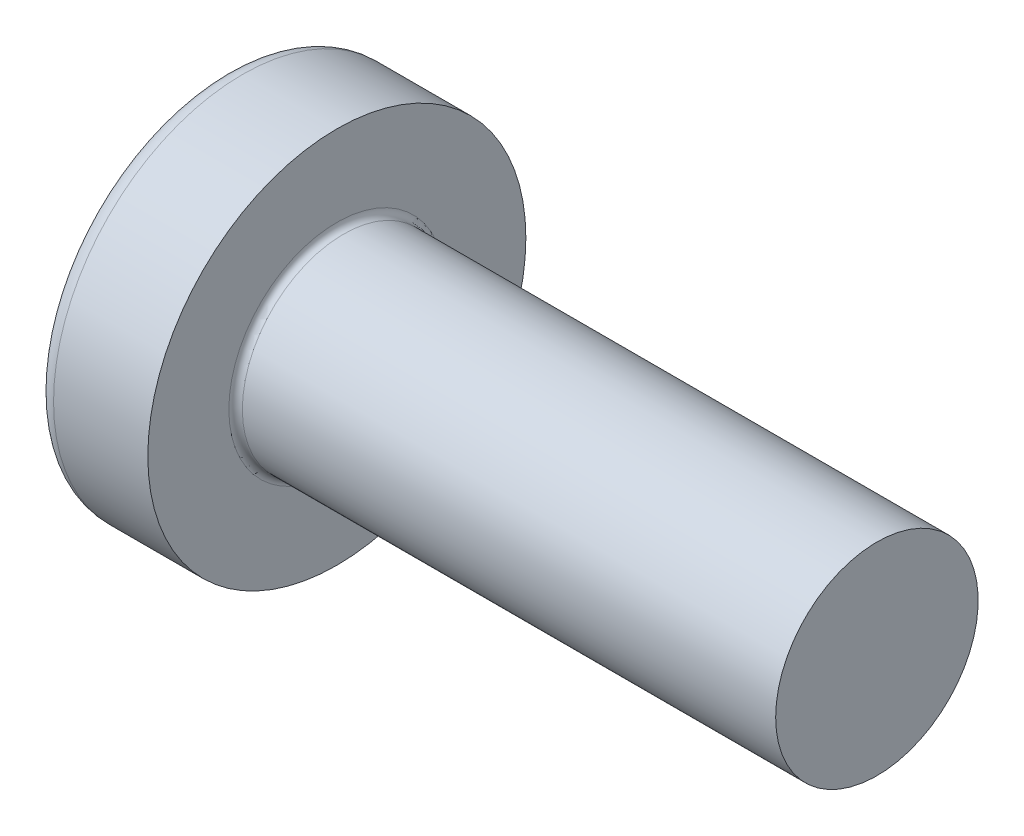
ISO-10303-21;
HEADER;
FILE_DESCRIPTION(('STEP AP214'),'2;1');
FILE_NAME('part.step','',(''),(''),'','','');
FILE_SCHEMA(('AUTOMOTIVE_DESIGN { 1 0 10303 214 1 1 1 1 }'));
ENDSEC;
DATA;
#1=APPLICATION_CONTEXT('core data for automotive mechanical design processes');
#2=APPLICATION_PROTOCOL_DEFINITION('international standard','automotive_design',2000,#1);
#3=PRODUCT_CONTEXT('',#1,'mechanical');
#4=PRODUCT('Part','Part','',(#3));
#5=PRODUCT_RELATED_PRODUCT_CATEGORY('part','',(#4));
#6=PRODUCT_DEFINITION_FORMATION('','',#4);
#7=PRODUCT_DEFINITION_CONTEXT('part definition',#1,'design');
#8=PRODUCT_DEFINITION('design','',#6,#7);
#9=PRODUCT_DEFINITION_SHAPE('','',#8);
#10=(LENGTH_UNIT() NAMED_UNIT(*) SI_UNIT(.MILLI.,.METRE.));
#11=(NAMED_UNIT(*) PLANE_ANGLE_UNIT() SI_UNIT($,.RADIAN.));
#12=(NAMED_UNIT(*) SI_UNIT($,.STERADIAN.) SOLID_ANGLE_UNIT());
#13=UNCERTAINTY_MEASURE_WITH_UNIT(LENGTH_MEASURE(1.E-05),#10,'distance_accuracy_value','');
#14=(GEOMETRIC_REPRESENTATION_CONTEXT(3) GLOBAL_UNCERTAINTY_ASSIGNED_CONTEXT((#13)) GLOBAL_UNIT_ASSIGNED_CONTEXT((#10,
#11,#12)) REPRESENTATION_CONTEXT('',''));
#15=CARTESIAN_POINT('',(0.,0.,0.));
#16=DIRECTION('',(0.,0.,1.));
#17=DIRECTION('',(1.,0.,0.));
#18=AXIS2_PLACEMENT_3D('',#15,#16,#17);
#19=CARTESIAN_POINT('',(5.,0.,0.));
#20=DIRECTION('',(-1.,0.,0.));
#21=DIRECTION('',(0.,1.,0.));
#22=AXIS2_PLACEMENT_3D('',#19,#20,#21);
#23=SPHERICAL_SURFACE('',#22,5.);
#24=CARTESIAN_POINT('',(0.775371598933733,0.,0.));
#25=DIRECTION('',(-1.,0.,0.));
#26=DIRECTION('',(0.,0.,1.));
#27=AXIS2_PLACEMENT_3D('',#24,#25,#26);
#28=CIRCLE('',#27,2.67441860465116);
#29=CARTESIAN_POINT('',(0.775371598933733,0.,2.67441860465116));
#30=VERTEX_POINT('',#29);
#31=EDGE_CURVE('E233',#30,#30,#28,.T.);
#32=ORIENTED_EDGE('',*,*,#31,.T.);
#33=EDGE_LOOP('',(#32));
#34=FACE_BOUND('',#33,.T.);
#35=CARTESIAN_POINT('',(0.0457951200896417,0.,0.));
#36=DIRECTION('',(1.,0.,0.));
#37=DIRECTION('',(0.,0.,-1.));
#38=AXIS2_PLACEMENT_3D('',#35,#36,#37);
#39=CIRCLE('',#38,0.675169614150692);
#40=CARTESIAN_POINT('',(0.0457951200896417,-0.369999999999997,-0.564760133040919));
#41=VERTEX_POINT('',#40);
#42=CARTESIAN_POINT('',(0.0457951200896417,-0.564760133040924,-0.37));
#43=VERTEX_POINT('',#42);
#44=EDGE_CURVE('E369',#41,#43,#39,.F.);
#45=ORIENTED_EDGE('',*,*,#44,.F.);
#46=CARTESIAN_POINT('',(5.,-0.370000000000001,0.));
#47=DIRECTION('',(0.,1.,0.));
#48=DIRECTION('',(0.,0.,1.));
#49=AXIS2_PLACEMENT_3D('',#46,#47,#48);
#50=CIRCLE('',#49,4.98629120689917);
#51=CARTESIAN_POINT('',(0.187869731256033,-0.369999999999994,-1.30633161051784));
#52=VERTEX_POINT('',#51);
#53=EDGE_CURVE('E295',#52,#41,#50,.T.);
#54=ORIENTED_EDGE('',*,*,#53,.F.);
#55=CARTESIAN_POINT('',(4.56358245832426,0.,0.87531820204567));
#56=DIRECTION('',(0.446197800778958,0.,-0.89493436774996));
#57=DIRECTION('',(-0.89493436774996,0.,-0.446197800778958));
#58=AXIS2_PLACEMENT_3D('',#55,#56,#57);
#59=CIRCLE('',#58,4.90340267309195);
#60=CARTESIAN_POINT('',(0.187869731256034,0.370000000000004,-1.30633161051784));
#61=VERTEX_POINT('',#60);
#62=EDGE_CURVE('E267',#52,#61,#59,.T.);
#63=ORIENTED_EDGE('',*,*,#62,.T.);
#64=CARTESIAN_POINT('',(5.,0.37,0.));
#65=DIRECTION('',(0.,-1.,0.));
#66=DIRECTION('',(0.,0.,-1.));
#67=AXIS2_PLACEMENT_3D('',#64,#65,#66);
#68=CIRCLE('',#67,4.98629120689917);
#69=CARTESIAN_POINT('',(0.0457951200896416,0.370000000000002,-0.564760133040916));
#70=VERTEX_POINT('',#69);
#71=EDGE_CURVE('E322',#70,#61,#68,.T.);
#72=ORIENTED_EDGE('',*,*,#71,.F.);
#73=CARTESIAN_POINT('',(0.0457951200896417,0.564760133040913,-0.37));
#74=VERTEX_POINT('',#73);
#75=EDGE_CURVE('E388',#74,#70,#39,.F.);
#76=ORIENTED_EDGE('',*,*,#75,.F.);
#77=CARTESIAN_POINT('',(5.,0.,-0.37));
#78=DIRECTION('',(0.,0.,1.));
#79=DIRECTION('',(0.,-1.,0.));
#80=AXIS2_PLACEMENT_3D('',#77,#78,#79);
#81=CIRCLE('',#80,4.98629120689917);
#82=CARTESIAN_POINT('',(0.187869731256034,1.30633161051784,-0.37));
#83=VERTEX_POINT('',#82);
#84=EDGE_CURVE('E261',#83,#74,#81,.T.);
#85=ORIENTED_EDGE('',*,*,#84,.F.);
#86=CARTESIAN_POINT('',(4.56358245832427,-0.87531820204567,0.));
#87=DIRECTION('',(0.446197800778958,0.89493436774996,0.));
#88=DIRECTION('',(-0.89493436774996,0.446197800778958,0.));
#89=AXIS2_PLACEMENT_3D('',#86,#87,#88);
#90=CIRCLE('',#89,4.90340267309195);
#91=CARTESIAN_POINT('',(0.187869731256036,1.30633161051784,0.37));
#92=VERTEX_POINT('',#91);
#93=EDGE_CURVE('E264',#83,#92,#90,.T.);
#94=ORIENTED_EDGE('',*,*,#93,.T.);
#95=CARTESIAN_POINT('',(5.,0.,0.370000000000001));
#96=DIRECTION('',(0.,0.,-1.));
#97=DIRECTION('',(-1.,0.,0.));
#98=AXIS2_PLACEMENT_3D('',#95,#96,#97);
#99=CIRCLE('',#98,4.98629120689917);
#100=CARTESIAN_POINT('',(0.0457951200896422,0.564760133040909,0.369999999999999));
#101=VERTEX_POINT('',#100);
#102=EDGE_CURVE('E257',#101,#92,#99,.T.);
#103=ORIENTED_EDGE('',*,*,#102,.F.);
#104=CARTESIAN_POINT('',(0.0457951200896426,0.369999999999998,0.564760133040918));
#105=VERTEX_POINT('',#104);
#106=EDGE_CURVE('E387',#105,#101,#39,.F.);
#107=ORIENTED_EDGE('',*,*,#106,.F.);
#108=CARTESIAN_POINT('',(0.187869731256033,0.369999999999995,1.30633161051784));
#109=VERTEX_POINT('',#108);
#110=EDGE_CURVE('E277',#109,#105,#68,.T.);
#111=ORIENTED_EDGE('',*,*,#110,.F.);
#112=CARTESIAN_POINT('',(4.56358245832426,0.,-0.875318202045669));
#113=DIRECTION('',(0.446197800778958,0.,0.89493436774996));
#114=DIRECTION('',(0.89493436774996,0.,-0.446197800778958));
#115=AXIS2_PLACEMENT_3D('',#112,#113,#114);
#116=CIRCLE('',#115,4.90340267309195);
#117=CARTESIAN_POINT('',(0.187869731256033,-0.370000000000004,1.30633161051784));
#118=VERTEX_POINT('',#117);
#119=EDGE_CURVE('E44',#109,#118,#116,.T.);
#120=ORIENTED_EDGE('',*,*,#119,.T.);
#121=CARTESIAN_POINT('',(0.0457951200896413,-0.370000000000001,0.564760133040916));
#122=VERTEX_POINT('',#121);
#123=EDGE_CURVE('E274',#122,#118,#50,.T.);
#124=ORIENTED_EDGE('',*,*,#123,.F.);
#125=CARTESIAN_POINT('',(0.0457951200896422,-0.56476013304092,0.369999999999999));
#126=VERTEX_POINT('',#125);
#127=EDGE_CURVE('E423',#126,#122,#39,.F.);
#128=ORIENTED_EDGE('',*,*,#127,.F.);
#129=CARTESIAN_POINT('',(0.187869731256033,-1.30633161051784,0.369999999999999));
#130=VERTEX_POINT('',#129);
#131=EDGE_CURVE('E258',#130,#126,#99,.T.);
#132=ORIENTED_EDGE('',*,*,#131,.F.);
#133=CARTESIAN_POINT('',(4.56358245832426,0.875318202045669,0.));
#134=DIRECTION('',(0.446197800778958,-0.89493436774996,0.));
#135=DIRECTION('',(0.89493436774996,0.446197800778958,0.));
#136=AXIS2_PLACEMENT_3D('',#133,#134,#135);
#137=CIRCLE('',#136,4.90340267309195);
#138=CARTESIAN_POINT('',(0.187869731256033,-1.30633161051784,-0.37));
#139=VERTEX_POINT('',#138);
#140=EDGE_CURVE('E254',#130,#139,#137,.T.);
#141=ORIENTED_EDGE('',*,*,#140,.T.);
#142=EDGE_CURVE('E59',#43,#139,#81,.T.);
#143=ORIENTED_EDGE('',*,*,#142,.F.);
#144=EDGE_LOOP('',(#45,#54,#63,#72,#76,#85,#94,#103,#107,#111,#120,#124,#128,#132,#141,#143));
#145=FACE_BOUND('',#144,.T.);
#146=ADVANCED_FACE('F31',(#34,#145),#23,.T.);
#147=CARTESIAN_POINT('',(1.75,0.527482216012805,-0.37));
#148=DIRECTION('',(0.,0.,1.));
#149=DIRECTION('',(0.,-1.,0.));
#150=AXIS2_PLACEMENT_3D('',#147,#148,#149);
#151=PLANE('',#150);
#152=ORIENTED_EDGE('',*,*,#84,.T.);
#153=CARTESIAN_POINT('',(-0.987293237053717,0.649401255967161,-0.37));
#154=CARTESIAN_POINT('',(-0.781914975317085,0.632865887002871,-0.37));
#155=CARTESIAN_POINT('',(-0.576547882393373,0.616188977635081,-0.37));
#156=CARTESIAN_POINT('',(-0.165841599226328,0.582441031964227,-0.37));
#157=CARTESIAN_POINT('',(0.0394975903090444,0.56536998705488,-0.37));
#158=CARTESIAN_POINT('',(0.450133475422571,0.530723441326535,-0.37));
#159=CARTESIAN_POINT('',(0.655430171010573,0.513147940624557,-0.37));
#160=CARTESIAN_POINT('',(1.06596140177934,0.477314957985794,-0.37));
#161=CARTESIAN_POINT('',(1.2711959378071,0.459057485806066,-0.37));
#162=CARTESIAN_POINT('',(1.61065292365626,0.428051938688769,-0.37));
#163=CARTESIAN_POINT('',(1.74490059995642,0.415580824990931,-0.37));
#164=CARTESIAN_POINT('',(2.01334321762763,0.390092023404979,-0.37));
#165=CARTESIAN_POINT('',(2.14753815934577,0.377074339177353,-0.37));
#166=CARTESIAN_POINT('',(2.41586354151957,0.350315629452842,-0.37));
#167=CARTESIAN_POINT('',(2.5499939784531,0.33657456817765,-0.37));
#168=CARTESIAN_POINT('',(2.81814173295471,0.308004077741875,-0.37));
#169=CARTESIAN_POINT('',(2.95215904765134,0.293174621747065,-0.37));
#170=CARTESIAN_POINT('',(3.0860955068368,0.277618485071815,-0.37));
#171=B_SPLINE_CURVE_WITH_KNOTS('',3,(#153,#154,#155,#156,#157,#158,#159,#160,#161,#162,#163,
#164,#165,#166,#167,#168,#169,#170),.UNSPECIFIED.,.F.,.F.,(4,2,2,2,2,2,2,2,4),(0.,
0.618128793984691,1.23627109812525,1.85441325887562,2.4725465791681,2.87702276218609,
3.28149623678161,3.68598973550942,4.09049321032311),.UNSPECIFIED.);
#172=CARTESIAN_POINT('',(1.75,0.415013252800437,-0.370000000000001));
#173=VERTEX_POINT('',#172);
#174=EDGE_CURVE('E409',#74,#173,#171,.T.);
#175=ORIENTED_EDGE('',*,*,#174,.T.);
#176=DIRECTION('',(0.,1.,0.));
#177=VECTOR('',#176,1.);
#178=CARTESIAN_POINT('',(1.75,-0.527482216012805,-0.37));
#179=LINE('',#178,#177);
#180=CARTESIAN_POINT('',(1.75,0.527482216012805,-0.37));
#181=VERTEX_POINT('',#180);
#182=EDGE_CURVE('E351',#173,#181,#179,.T.);
#183=ORIENTED_EDGE('',*,*,#182,.T.);
#184=DIRECTION('',(0.89493436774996,-0.446197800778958,0.));
#185=VECTOR('',#184,1.);
#186=CARTESIAN_POINT('',(0.,1.4,-0.37));
#187=LINE('',#186,#185);
#188=EDGE_CURVE('E234',#83,#181,#187,.T.);
#189=ORIENTED_EDGE('',*,*,#188,.F.);
#190=EDGE_LOOP('',(#152,#175,#183,#189));
#191=FACE_BOUND('',#190,.T.);
#192=ADVANCED_FACE('F189',(#191),#151,.T.);
#193=CARTESIAN_POINT('',(1.75,-0.527482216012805,-0.37));
#194=VERTEX_POINT('',#193);
#195=CARTESIAN_POINT('',(1.75,-0.415013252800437,-0.37));
#196=VERTEX_POINT('',#195);
#197=EDGE_CURVE('E242',#194,#196,#179,.T.);
#198=ORIENTED_EDGE('',*,*,#197,.T.);
#199=CARTESIAN_POINT('',(-0.987293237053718,-0.649401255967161,-0.37));
#200=CARTESIAN_POINT('',(-0.781914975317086,-0.632865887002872,-0.37));
#201=CARTESIAN_POINT('',(-0.576547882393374,-0.616188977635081,-0.37));
#202=CARTESIAN_POINT('',(-0.165841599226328,-0.582441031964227,-0.37));
#203=CARTESIAN_POINT('',(0.0394975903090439,-0.56536998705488,-0.37));
#204=CARTESIAN_POINT('',(0.450133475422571,-0.530723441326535,-0.37));
#205=CARTESIAN_POINT('',(0.655430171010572,-0.513147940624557,-0.37));
#206=CARTESIAN_POINT('',(1.06596140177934,-0.477314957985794,-0.37));
#207=CARTESIAN_POINT('',(1.2711959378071,-0.459057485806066,-0.37));
#208=CARTESIAN_POINT('',(1.61065292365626,-0.428051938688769,-0.37));
#209=CARTESIAN_POINT('',(1.74490059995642,-0.415580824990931,-0.37));
#210=CARTESIAN_POINT('',(2.01334321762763,-0.39009202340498,-0.37));
#211=CARTESIAN_POINT('',(2.14753815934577,-0.377074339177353,-0.37));
#212=CARTESIAN_POINT('',(2.41586354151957,-0.350315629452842,-0.37));
#213=CARTESIAN_POINT('',(2.5499939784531,-0.33657456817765,-0.37));
#214=CARTESIAN_POINT('',(2.81814173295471,-0.308004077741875,-0.37));
#215=CARTESIAN_POINT('',(2.95215904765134,-0.293174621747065,-0.37));
#216=CARTESIAN_POINT('',(3.0860955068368,-0.277618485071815,-0.37));
#217=B_SPLINE_CURVE_WITH_KNOTS('',3,(#199,#200,#201,#202,#203,#204,#205,#206,#207,#208,#209,
#210,#211,#212,#213,#214,#215,#216),.UNSPECIFIED.,.F.,.F.,(4,2,2,2,2,2,2,2,4),(0.,
0.618128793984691,1.23627109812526,1.85441325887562,2.4725465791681,2.87702276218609,
3.28149623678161,3.68598973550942,4.09049321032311),.UNSPECIFIED.);
#218=EDGE_CURVE('E386',#196,#43,#217,.F.);
#219=ORIENTED_EDGE('',*,*,#218,.T.);
#220=ORIENTED_EDGE('',*,*,#142,.T.);
#221=DIRECTION('',(0.89493436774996,0.446197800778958,0.));
#222=VECTOR('',#221,1.);
#223=CARTESIAN_POINT('',(0.,-1.4,-0.37));
#224=LINE('',#223,#222);
#225=EDGE_CURVE('E325',#139,#194,#224,.T.);
#226=ORIENTED_EDGE('',*,*,#225,.T.);
#227=EDGE_LOOP('',(#198,#219,#220,#226));
#228=FACE_BOUND('',#227,.T.);
#229=ADVANCED_FACE('F195',(#228),#151,.T.);
#230=CARTESIAN_POINT('',(1.75,-0.527482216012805,0.37));
#231=DIRECTION('',(0.,0.,-1.));
#232=DIRECTION('',(-1.,0.,0.));
#233=AXIS2_PLACEMENT_3D('',#230,#231,#232);
#234=PLANE('',#233);
#235=DIRECTION('',(0.,-1.,0.));
#236=VECTOR('',#235,1.);
#237=CARTESIAN_POINT('',(1.75,0.527482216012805,0.37));
#238=LINE('',#237,#236);
#239=CARTESIAN_POINT('',(1.75,0.527482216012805,0.37));
#240=VERTEX_POINT('',#239);
#241=CARTESIAN_POINT('',(1.75,0.415013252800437,0.37));
#242=VERTEX_POINT('',#241);
#243=EDGE_CURVE('E334',#240,#242,#238,.T.);
#244=ORIENTED_EDGE('',*,*,#243,.T.);
#245=CARTESIAN_POINT('',(-0.987293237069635,0.649401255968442,0.369999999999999));
#246=CARTESIAN_POINT('',(-0.781914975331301,0.632865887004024,0.369999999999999));
#247=CARTESIAN_POINT('',(-0.576547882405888,0.616188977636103,0.369999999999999));
#248=CARTESIAN_POINT('',(-0.165841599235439,0.582441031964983,0.369999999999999));
#249=CARTESIAN_POINT('',(0.039497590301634,0.5653699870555,0.369999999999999));
#250=CARTESIAN_POINT('',(0.450133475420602,0.530723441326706,0.37));
#251=CARTESIAN_POINT('',(0.655430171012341,0.513147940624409,0.37));
#252=CARTESIAN_POINT('',(1.06596140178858,0.477314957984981,0.37));
#253=CARTESIAN_POINT('',(1.27119593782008,0.459057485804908,0.37));
#254=CARTESIAN_POINT('',(1.61065292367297,0.428051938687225,0.37));
#255=CARTESIAN_POINT('',(1.74490059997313,0.415580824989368,0.37));
#256=CARTESIAN_POINT('',(2.01334321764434,0.390092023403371,0.37));
#257=CARTESIAN_POINT('',(2.14753815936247,0.377074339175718,0.37));
#258=CARTESIAN_POINT('',(2.41586354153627,0.350315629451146,0.37));
#259=CARTESIAN_POINT('',(2.54999397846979,0.336574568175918,0.37));
#260=CARTESIAN_POINT('',(2.8181417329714,0.308004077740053,0.37));
#261=CARTESIAN_POINT('',(2.95215904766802,0.293174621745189,0.37));
#262=CARTESIAN_POINT('',(3.08609550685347,0.277618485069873,0.37));
#263=B_SPLINE_CURVE_WITH_KNOTS('',3,(#245,#246,#247,#248,#249,#250,#251,#252,#253,#254,#255,
#256,#257,#258,#259,#260,#261,#262),.UNSPECIFIED.,.F.,.F.,(4,2,2,2,2,2,2,2,4),(0.,
0.618128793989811,1.23627109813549,1.85441325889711,2.47254657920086,2.87702276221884,
3.28149623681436,3.68598973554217,4.09049321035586),.UNSPECIFIED.);
#264=EDGE_CURVE('E659',#242,#101,#263,.F.);
#265=ORIENTED_EDGE('',*,*,#264,.T.);
#266=ORIENTED_EDGE('',*,*,#102,.T.);
#267=DIRECTION('',(0.89493436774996,-0.446197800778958,0.));
#268=VECTOR('',#267,1.);
#269=CARTESIAN_POINT('',(0.,1.4,0.37));
#270=LINE('',#269,#268);
#271=EDGE_CURVE('E239',#92,#240,#270,.T.);
#272=ORIENTED_EDGE('',*,*,#271,.T.);
#273=EDGE_LOOP('',(#244,#265,#266,#272));
#274=FACE_BOUND('',#273,.T.);
#275=ADVANCED_FACE('F405',(#274),#234,.T.);
#276=ORIENTED_EDGE('',*,*,#131,.T.);
#277=CARTESIAN_POINT('',(-0.987293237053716,-0.649401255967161,0.369999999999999));
#278=CARTESIAN_POINT('',(-0.781914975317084,-0.632865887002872,0.369999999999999));
#279=CARTESIAN_POINT('',(-0.576547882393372,-0.616188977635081,0.369999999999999));
#280=CARTESIAN_POINT('',(-0.165841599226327,-0.582441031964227,0.369999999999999));
#281=CARTESIAN_POINT('',(0.0394975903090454,-0.56536998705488,0.369999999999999));
#282=CARTESIAN_POINT('',(0.450133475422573,-0.530723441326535,0.369999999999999));
#283=CARTESIAN_POINT('',(0.655430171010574,-0.513147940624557,0.369999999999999));
#284=CARTESIAN_POINT('',(1.06596140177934,-0.477314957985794,0.369999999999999));
#285=CARTESIAN_POINT('',(1.2711959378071,-0.459057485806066,0.37));
#286=CARTESIAN_POINT('',(1.61065292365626,-0.428051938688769,0.37));
#287=CARTESIAN_POINT('',(1.74490059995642,-0.415580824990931,0.37));
#288=CARTESIAN_POINT('',(2.01334321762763,-0.39009202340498,0.37));
#289=CARTESIAN_POINT('',(2.14753815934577,-0.377074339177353,0.37));
#290=CARTESIAN_POINT('',(2.41586354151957,-0.350315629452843,0.37));
#291=CARTESIAN_POINT('',(2.5499939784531,-0.33657456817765,0.37));
#292=CARTESIAN_POINT('',(2.81814173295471,-0.308004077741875,0.37));
#293=CARTESIAN_POINT('',(2.95215904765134,-0.293174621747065,0.37));
#294=CARTESIAN_POINT('',(3.0860955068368,-0.277618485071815,0.37));
#295=B_SPLINE_CURVE_WITH_KNOTS('',3,(#277,#278,#279,#280,#281,#282,#283,#284,#285,#286,#287,
#288,#289,#290,#291,#292,#293,#294),.UNSPECIFIED.,.F.,.F.,(4,2,2,2,2,2,2,2,4),(0.,
0.618128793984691,1.23627109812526,1.85441325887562,2.4725465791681,2.87702276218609,
3.28149623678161,3.68598973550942,4.09049321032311),.UNSPECIFIED.);
#296=CARTESIAN_POINT('',(1.75,-0.415013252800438,0.37));
#297=VERTEX_POINT('',#296);
#298=EDGE_CURVE('E424',#126,#297,#295,.T.);
#299=ORIENTED_EDGE('',*,*,#298,.T.);
#300=CARTESIAN_POINT('',(1.75,-0.527482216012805,0.37));
#301=VERTEX_POINT('',#300);
#302=EDGE_CURVE('E336',#297,#301,#238,.T.);
#303=ORIENTED_EDGE('',*,*,#302,.T.);
#304=DIRECTION('',(0.89493436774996,0.446197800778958,0.));
#305=VECTOR('',#304,1.);
#306=CARTESIAN_POINT('',(0.,-1.4,0.369999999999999));
#307=LINE('',#306,#305);
#308=EDGE_CURVE('E327',#130,#301,#307,.T.);
#309=ORIENTED_EDGE('',*,*,#308,.F.);
#310=EDGE_LOOP('',(#276,#299,#303,#309));
#311=FACE_BOUND('',#310,.T.);
#312=ADVANCED_FACE('F515',(#311),#234,.T.);
#313=CARTESIAN_POINT('',(1.75,0.527482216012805,0.37));
#314=DIRECTION('',(0.446197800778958,0.89493436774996,0.));
#315=DIRECTION('',(-0.89493436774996,0.446197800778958,0.));
#316=AXIS2_PLACEMENT_3D('',#313,#314,#315);
#317=PLANE('',#316);
#318=CARTESIAN_POINT('',(2.66965234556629,0.0689604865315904,0.));
#319=DIRECTION('',(0.446197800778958,0.89493436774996,0.));
#320=DIRECTION('',(-0.89493436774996,0.446197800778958,0.));
#321=AXIS2_PLACEMENT_3D('',#318,#319,#320);
#322=ELLIPSE('',#321,1.10195891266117,0.486831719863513);
#323=CARTESIAN_POINT('',(1.75,0.527482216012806,0.175779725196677));
#324=VERTEX_POINT('',#323);
#325=CARTESIAN_POINT('',(1.75,0.527482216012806,-0.175779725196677));
#326=VERTEX_POINT('',#325);
#327=EDGE_CURVE('E300',#324,#326,#322,.F.);
#328=ORIENTED_EDGE('',*,*,#327,.F.);
#329=DIRECTION('',(0.,0.,-1.));
#330=VECTOR('',#329,1.);
#331=CARTESIAN_POINT('',(1.75,0.527482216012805,0.37));
#332=LINE('',#331,#330);
#333=EDGE_CURVE('E337',#240,#324,#332,.T.);
#334=ORIENTED_EDGE('',*,*,#333,.F.);
#335=ORIENTED_EDGE('',*,*,#271,.F.);
#336=ORIENTED_EDGE('',*,*,#93,.F.);
#337=ORIENTED_EDGE('',*,*,#188,.T.);
#338=EDGE_CURVE('E339',#326,#181,#332,.T.);
#339=ORIENTED_EDGE('',*,*,#338,.F.);
#340=EDGE_LOOP('',(#328,#334,#335,#336,#337,#339));
#341=FACE_BOUND('',#340,.T.);
#342=ADVANCED_FACE('F403',(#341),#317,.F.);
#343=CARTESIAN_POINT('',(0.,-1.4,-0.37));
#344=DIRECTION('',(0.446197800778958,-0.89493436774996,0.));
#345=DIRECTION('',(0.89493436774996,0.446197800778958,0.));
#346=AXIS2_PLACEMENT_3D('',#343,#344,#345);
#347=PLANE('',#346);
#348=CARTESIAN_POINT('',(2.66965234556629,-0.0689604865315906,0.));
#349=DIRECTION('',(0.446197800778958,-0.89493436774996,0.));
#350=DIRECTION('',(-0.89493436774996,-0.446197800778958,0.));
#351=AXIS2_PLACEMENT_3D('',#348,#349,#350);
#352=ELLIPSE('',#351,1.10195891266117,0.486831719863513);
#353=CARTESIAN_POINT('',(1.75,-0.527482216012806,-0.175779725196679));
#354=VERTEX_POINT('',#353);
#355=CARTESIAN_POINT('',(1.75,-0.527482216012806,0.175779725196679));
#356=VERTEX_POINT('',#355);
#357=EDGE_CURVE('E661',#354,#356,#352,.F.);
#358=ORIENTED_EDGE('',*,*,#357,.F.);
#359=DIRECTION('',(0.,0.,1.));
#360=VECTOR('',#359,1.);
#361=CARTESIAN_POINT('',(1.75,-0.527482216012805,-0.37));
#362=LINE('',#361,#360);
#363=EDGE_CURVE('E330',#194,#354,#362,.T.);
#364=ORIENTED_EDGE('',*,*,#363,.F.);
#365=ORIENTED_EDGE('',*,*,#225,.F.);
#366=ORIENTED_EDGE('',*,*,#140,.F.);
#367=ORIENTED_EDGE('',*,*,#308,.T.);
#368=EDGE_CURVE('E333',#356,#301,#362,.T.);
#369=ORIENTED_EDGE('',*,*,#368,.F.);
#370=EDGE_LOOP('',(#358,#364,#365,#366,#367,#369));
#371=FACE_BOUND('',#370,.T.);
#372=ADVANCED_FACE('F502',(#371),#347,.F.);
#373=CARTESIAN_POINT('',(1.75,0.527482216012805,-0.37));
#374=DIRECTION('',(-1.,0.,0.));
#375=DIRECTION('',(0.,0.,1.));
#376=AXIS2_PLACEMENT_3D('',#373,#374,#375);
#377=PLANE('',#376);
#378=DIRECTION('',(0.,1.,0.));
#379=VECTOR('',#378,1.);
#380=CARTESIAN_POINT('',(1.75,-0.370000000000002,0.527482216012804));
#381=LINE('',#380,#379);
#382=CARTESIAN_POINT('',(1.75,-0.370000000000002,0.527482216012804));
#383=VERTEX_POINT('',#382);
#384=CARTESIAN_POINT('',(1.75,-0.175779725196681,0.527482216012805));
#385=VERTEX_POINT('',#384);
#386=EDGE_CURVE('E315',#383,#385,#381,.T.);
#387=ORIENTED_EDGE('',*,*,#386,.T.);
#388=CARTESIAN_POINT('',(1.75,0.,0.));
#389=DIRECTION('',(-1.,0.,0.));
#390=DIRECTION('',(0.,0.,1.));
#391=AXIS2_PLACEMENT_3D('',#388,#389,#390);
#392=CIRCLE('',#391,0.556);
#393=CARTESIAN_POINT('',(1.75,-0.370000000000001,0.415013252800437));
#394=VERTEX_POINT('',#393);
#395=EDGE_CURVE('E687',#394,#385,#392,.T.);
#396=ORIENTED_EDGE('',*,*,#395,.F.);
#397=DIRECTION('',(0.,0.,-1.));
#398=VECTOR('',#397,1.);
#399=CARTESIAN_POINT('',(1.75,-0.370000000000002,0.527482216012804));
#400=LINE('',#399,#398);
#401=EDGE_CURVE('E311',#383,#394,#400,.T.);
#402=ORIENTED_EDGE('',*,*,#401,.F.);
#403=EDGE_LOOP('',(#387,#396,#402));
#404=FACE_BOUND('',#403,.T.);
#405=ADVANCED_FACE('F459',(#404),#377,.T.);
#406=ORIENTED_EDGE('',*,*,#302,.F.);
#407=EDGE_CURVE('E692',#356,#297,#392,.T.);
#408=ORIENTED_EDGE('',*,*,#407,.F.);
#409=ORIENTED_EDGE('',*,*,#368,.T.);
#410=EDGE_LOOP('',(#406,#408,#409));
#411=FACE_BOUND('',#410,.T.);
#412=ADVANCED_FACE('F489',(#411),#377,.T.);
#413=ORIENTED_EDGE('',*,*,#363,.T.);
#414=EDGE_CURVE('E380',#196,#354,#392,.T.);
#415=ORIENTED_EDGE('',*,*,#414,.F.);
#416=ORIENTED_EDGE('',*,*,#197,.F.);
#417=EDGE_LOOP('',(#413,#415,#416));
#418=FACE_BOUND('',#417,.T.);
#419=ADVANCED_FACE('F483',(#418),#377,.T.);
#420=CARTESIAN_POINT('',(1.75,-0.369999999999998,-0.415013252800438));
#421=VERTEX_POINT('',#420);
#422=CARTESIAN_POINT('',(1.75,-0.369999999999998,-0.527482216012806));
#423=VERTEX_POINT('',#422);
#424=EDGE_CURVE('E314',#421,#423,#400,.T.);
#425=ORIENTED_EDGE('',*,*,#424,.F.);
#426=CARTESIAN_POINT('',(1.75,-0.17577972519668,-0.527482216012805));
#427=VERTEX_POINT('',#426);
#428=EDGE_CURVE('E51',#427,#421,#392,.T.);
#429=ORIENTED_EDGE('',*,*,#428,.F.);
#430=DIRECTION('',(0.,-1.,0.));
#431=VECTOR('',#430,1.);
#432=CARTESIAN_POINT('',(1.75,0.370000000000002,-0.527482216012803));
#433=LINE('',#432,#431);
#434=EDGE_CURVE('E310',#427,#423,#433,.T.);
#435=ORIENTED_EDGE('',*,*,#434,.T.);
#436=EDGE_LOOP('',(#425,#429,#435));
#437=FACE_BOUND('',#436,.T.);
#438=ADVANCED_FACE('F375',(#437),#377,.T.);
#439=CARTESIAN_POINT('',(1.75,0.370000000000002,-0.527482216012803));
#440=VERTEX_POINT('',#439);
#441=CARTESIAN_POINT('',(1.75,0.175779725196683,-0.527482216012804));
#442=VERTEX_POINT('',#441);
#443=EDGE_CURVE('E307',#440,#442,#433,.T.);
#444=ORIENTED_EDGE('',*,*,#443,.T.);
#445=CARTESIAN_POINT('',(1.75,0.370000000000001,-0.415013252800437));
#446=VERTEX_POINT('',#445);
#447=EDGE_CURVE('E379',#446,#442,#392,.T.);
#448=ORIENTED_EDGE('',*,*,#447,.F.);
#449=DIRECTION('',(0.,0.,1.));
#450=VECTOR('',#449,1.);
#451=CARTESIAN_POINT('',(1.75,0.370000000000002,-0.527482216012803));
#452=LINE('',#451,#450);
#453=EDGE_CURVE('E319',#440,#446,#452,.T.);
#454=ORIENTED_EDGE('',*,*,#453,.F.);
#455=EDGE_LOOP('',(#444,#448,#454));
#456=FACE_BOUND('',#455,.T.);
#457=ADVANCED_FACE('F471',(#456),#377,.T.);
#458=ORIENTED_EDGE('',*,*,#182,.F.);
#459=EDGE_CURVE('E676',#326,#173,#392,.T.);
#460=ORIENTED_EDGE('',*,*,#459,.F.);
#461=ORIENTED_EDGE('',*,*,#338,.T.);
#462=EDGE_LOOP('',(#458,#460,#461));
#463=FACE_BOUND('',#462,.T.);
#464=ADVANCED_FACE('F465',(#463),#377,.T.);
#465=ORIENTED_EDGE('',*,*,#333,.T.);
#466=EDGE_CURVE('E678',#242,#324,#392,.T.);
#467=ORIENTED_EDGE('',*,*,#466,.F.);
#468=ORIENTED_EDGE('',*,*,#243,.F.);
#469=EDGE_LOOP('',(#465,#467,#468));
#470=FACE_BOUND('',#469,.T.);
#471=ADVANCED_FACE('F457',(#470),#377,.T.);
#472=CARTESIAN_POINT('',(1.75,0.369999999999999,0.415013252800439));
#473=VERTEX_POINT('',#472);
#474=CARTESIAN_POINT('',(1.75,0.369999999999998,0.527482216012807));
#475=VERTEX_POINT('',#474);
#476=EDGE_CURVE('E292',#473,#475,#452,.T.);
#477=ORIENTED_EDGE('',*,*,#476,.F.);
#478=CARTESIAN_POINT('',(1.75,0.175779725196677,0.527482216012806));
#479=VERTEX_POINT('',#478);
#480=EDGE_CURVE('E381',#479,#473,#392,.T.);
#481=ORIENTED_EDGE('',*,*,#480,.F.);
#482=EDGE_CURVE('E318',#479,#475,#381,.T.);
#483=ORIENTED_EDGE('',*,*,#482,.T.);
#484=EDGE_LOOP('',(#477,#481,#483));
#485=FACE_BOUND('',#484,.T.);
#486=ADVANCED_FACE('F451',(#485),#377,.T.);
#487=CARTESIAN_POINT('',(1.75,0.369999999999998,0.527482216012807));
#488=DIRECTION('',(0.,-1.,0.));
#489=DIRECTION('',(0.,0.,-1.));
#490=AXIS2_PLACEMENT_3D('',#487,#488,#489);
#491=PLANE('',#490);
#492=ORIENTED_EDGE('',*,*,#110,.T.);
#493=CARTESIAN_POINT('',(-0.987293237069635,0.369999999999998,0.649401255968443));
#494=CARTESIAN_POINT('',(-0.781914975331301,0.369999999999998,0.632865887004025));
#495=CARTESIAN_POINT('',(-0.576547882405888,0.369999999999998,0.616188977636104));
#496=CARTESIAN_POINT('',(-0.165841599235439,0.369999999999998,0.582441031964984));
#497=CARTESIAN_POINT('',(0.0394975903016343,0.369999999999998,0.565369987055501));
#498=CARTESIAN_POINT('',(0.450133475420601,0.369999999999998,0.530723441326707));
#499=CARTESIAN_POINT('',(0.655430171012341,0.369999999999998,0.51314794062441));
#500=CARTESIAN_POINT('',(1.06596140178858,0.369999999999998,0.477314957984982));
#501=CARTESIAN_POINT('',(1.27119593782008,0.369999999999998,0.459057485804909));
#502=CARTESIAN_POINT('',(1.61065292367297,0.369999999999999,0.428051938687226));
#503=CARTESIAN_POINT('',(1.74490059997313,0.369999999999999,0.415580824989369));
#504=CARTESIAN_POINT('',(2.01334321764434,0.369999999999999,0.390092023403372));
#505=CARTESIAN_POINT('',(2.14753815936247,0.369999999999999,0.377074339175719));
#506=CARTESIAN_POINT('',(2.41586354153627,0.369999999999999,0.350315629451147));
#507=CARTESIAN_POINT('',(2.54999397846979,0.369999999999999,0.336574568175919));
#508=CARTESIAN_POINT('',(2.8181417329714,0.369999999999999,0.308004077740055));
#509=CARTESIAN_POINT('',(2.95215904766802,0.369999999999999,0.29317462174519));
#510=CARTESIAN_POINT('',(3.08609550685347,0.369999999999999,0.277618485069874));
#511=B_SPLINE_CURVE_WITH_KNOTS('',3,(#493,#494,#495,#496,#497,#498,#499,#500,#501,#502,#503,
#504,#505,#506,#507,#508,#509,#510),.UNSPECIFIED.,.F.,.F.,(4,2,2,2,2,2,2,2,4),(0.,
0.61812879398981,1.2362710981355,1.85441325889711,2.47254657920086,2.87702276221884,
3.28149623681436,3.68598973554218,4.09049321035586),.UNSPECIFIED.);
#512=EDGE_CURVE('E658',#105,#473,#511,.T.);
#513=ORIENTED_EDGE('',*,*,#512,.T.);
#514=ORIENTED_EDGE('',*,*,#476,.T.);
#515=DIRECTION('',(0.89493436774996,0.,-0.446197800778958));
#516=VECTOR('',#515,1.);
#517=CARTESIAN_POINT('',(0.,0.369999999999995,1.4));
#518=LINE('',#517,#516);
#519=EDGE_CURVE('E285',#109,#475,#518,.T.);
#520=ORIENTED_EDGE('',*,*,#519,.F.);
#521=EDGE_LOOP('',(#492,#513,#514,#520));
#522=FACE_BOUND('',#521,.T.);
#523=ADVANCED_FACE('F289',(#522),#491,.T.);
#524=CARTESIAN_POINT('',(1.75,-0.369999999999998,-0.527482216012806));
#525=DIRECTION('',(0.,1.,0.));
#526=DIRECTION('',(-1.,0.,0.));
#527=AXIS2_PLACEMENT_3D('',#524,#525,#526);
#528=PLANE('',#527);
#529=ORIENTED_EDGE('',*,*,#401,.T.);
#530=CARTESIAN_POINT('',(-0.987293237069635,-0.370000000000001,0.649401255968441));
#531=CARTESIAN_POINT('',(-0.781914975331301,-0.370000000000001,0.632865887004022));
#532=CARTESIAN_POINT('',(-0.576547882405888,-0.370000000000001,0.616188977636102));
#533=CARTESIAN_POINT('',(-0.16584159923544,-0.370000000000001,0.582441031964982));
#534=CARTESIAN_POINT('',(0.0394975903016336,-0.370000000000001,0.565369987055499));
#535=CARTESIAN_POINT('',(0.450133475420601,-0.370000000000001,0.530723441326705));
#536=CARTESIAN_POINT('',(0.655430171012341,-0.370000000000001,0.513147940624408));
#537=CARTESIAN_POINT('',(1.06596140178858,-0.370000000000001,0.47731495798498));
#538=CARTESIAN_POINT('',(1.27119593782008,-0.370000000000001,0.459057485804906));
#539=CARTESIAN_POINT('',(1.61065292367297,-0.370000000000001,0.428051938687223));
#540=CARTESIAN_POINT('',(1.74490059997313,-0.370000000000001,0.415580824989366));
#541=CARTESIAN_POINT('',(2.01334321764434,-0.370000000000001,0.390092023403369));
#542=CARTESIAN_POINT('',(2.14753815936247,-0.370000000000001,0.377074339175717));
#543=CARTESIAN_POINT('',(2.41586354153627,-0.370000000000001,0.350315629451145));
#544=CARTESIAN_POINT('',(2.54999397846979,-0.370000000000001,0.336574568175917));
#545=CARTESIAN_POINT('',(2.8181417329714,-0.370000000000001,0.308004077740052));
#546=CARTESIAN_POINT('',(2.95215904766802,-0.370000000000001,0.293174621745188));
#547=CARTESIAN_POINT('',(3.08609550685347,-0.370000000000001,0.277618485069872));
#548=B_SPLINE_CURVE_WITH_KNOTS('',3,(#530,#531,#532,#533,#534,#535,#536,#537,#538,#539,#540,
#541,#542,#543,#544,#545,#546,#547),.UNSPECIFIED.,.F.,.F.,(4,2,2,2,2,2,2,2,4),(0.,
0.61812879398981,1.23627109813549,1.85441325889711,2.47254657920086,2.87702276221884,
3.28149623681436,3.68598973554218,4.09049321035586),.UNSPECIFIED.);
#549=EDGE_CURVE('E417',#394,#122,#548,.F.);
#550=ORIENTED_EDGE('',*,*,#549,.T.);
#551=ORIENTED_EDGE('',*,*,#123,.T.);
#552=DIRECTION('',(0.89493436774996,0.,-0.446197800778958));
#553=VECTOR('',#552,1.);
#554=CARTESIAN_POINT('',(0.,-0.370000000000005,1.4));
#555=LINE('',#554,#553);
#556=EDGE_CURVE('E287',#118,#383,#555,.T.);
#557=ORIENTED_EDGE('',*,*,#556,.T.);
#558=EDGE_LOOP('',(#529,#550,#551,#557));
#559=FACE_BOUND('',#558,.T.);
#560=ADVANCED_FACE('F224',(#559),#528,.T.);
#561=CARTESIAN_POINT('',(1.75,-0.370000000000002,0.527482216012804));
#562=DIRECTION('',(0.446197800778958,0.,0.89493436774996));
#563=DIRECTION('',(-0.89493436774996,0.,0.446197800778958));
#564=AXIS2_PLACEMENT_3D('',#561,#562,#563);
#565=PLANE('',#564);
#566=CARTESIAN_POINT('',(2.66965234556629,0.,0.0689604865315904));
#567=DIRECTION('',(0.446197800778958,0.,0.89493436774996));
#568=DIRECTION('',(-0.89493436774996,0.,0.446197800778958));
#569=AXIS2_PLACEMENT_3D('',#566,#567,#568);
#570=ELLIPSE('',#569,1.10195891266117,0.486831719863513);
#571=EDGE_CURVE('E415',#385,#479,#570,.F.);
#572=ORIENTED_EDGE('',*,*,#571,.F.);
#573=ORIENTED_EDGE('',*,*,#386,.F.);
#574=ORIENTED_EDGE('',*,*,#556,.F.);
#575=ORIENTED_EDGE('',*,*,#119,.F.);
#576=ORIENTED_EDGE('',*,*,#519,.T.);
#577=ORIENTED_EDGE('',*,*,#482,.F.);
#578=EDGE_LOOP('',(#572,#573,#574,#575,#576,#577));
#579=FACE_BOUND('',#578,.T.);
#580=ADVANCED_FACE('F283',(#579),#565,.F.);
#581=CARTESIAN_POINT('',(0.,0.370000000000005,-1.4));
#582=DIRECTION('',(0.446197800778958,0.,-0.89493436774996));
#583=DIRECTION('',(0.89493436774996,0.,0.446197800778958));
#584=AXIS2_PLACEMENT_3D('',#581,#582,#583);
#585=PLANE('',#584);
#586=CARTESIAN_POINT('',(2.66965234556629,0.,-0.0689604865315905));
#587=DIRECTION('',(0.446197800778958,0.,-0.89493436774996));
#588=DIRECTION('',(-0.89493436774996,0.,-0.446197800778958));
#589=AXIS2_PLACEMENT_3D('',#586,#587,#588);
#590=ELLIPSE('',#589,1.10195891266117,0.486831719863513);
#591=EDGE_CURVE('E373',#442,#427,#590,.F.);
#592=ORIENTED_EDGE('',*,*,#591,.F.);
#593=ORIENTED_EDGE('',*,*,#443,.F.);
#594=DIRECTION('',(0.89493436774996,0.,0.446197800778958));
#595=VECTOR('',#594,1.);
#596=CARTESIAN_POINT('',(0.,0.370000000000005,-1.4));
#597=LINE('',#596,#595);
#598=EDGE_CURVE('E297',#61,#440,#597,.T.);
#599=ORIENTED_EDGE('',*,*,#598,.F.);
#600=ORIENTED_EDGE('',*,*,#62,.F.);
#601=DIRECTION('',(0.89493436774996,0.,0.446197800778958));
#602=VECTOR('',#601,1.);
#603=CARTESIAN_POINT('',(0.,-0.369999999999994,-1.4));
#604=LINE('',#603,#602);
#605=EDGE_CURVE('E304',#52,#423,#604,.T.);
#606=ORIENTED_EDGE('',*,*,#605,.T.);
#607=ORIENTED_EDGE('',*,*,#434,.F.);
#608=EDGE_LOOP('',(#592,#593,#599,#600,#606,#607));
#609=FACE_BOUND('',#608,.T.);
#610=ADVANCED_FACE('F364',(#609),#585,.F.);
#611=ORIENTED_EDGE('',*,*,#453,.T.);
#612=CARTESIAN_POINT('',(-0.987293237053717,0.370000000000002,-0.64940125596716));
#613=CARTESIAN_POINT('',(-0.781914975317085,0.370000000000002,-0.63286588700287));
#614=CARTESIAN_POINT('',(-0.576547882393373,0.370000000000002,-0.61618897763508));
#615=CARTESIAN_POINT('',(-0.165841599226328,0.370000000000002,-0.582441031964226));
#616=CARTESIAN_POINT('',(0.0394975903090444,0.370000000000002,-0.565369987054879));
#617=CARTESIAN_POINT('',(0.450133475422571,0.370000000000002,-0.530723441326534));
#618=CARTESIAN_POINT('',(0.655430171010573,0.370000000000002,-0.513147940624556));
#619=CARTESIAN_POINT('',(1.06596140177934,0.370000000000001,-0.477314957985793));
#620=CARTESIAN_POINT('',(1.2711959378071,0.370000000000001,-0.459057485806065));
#621=CARTESIAN_POINT('',(1.61065292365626,0.370000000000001,-0.428051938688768));
#622=CARTESIAN_POINT('',(1.74490059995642,0.370000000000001,-0.41558082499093));
#623=CARTESIAN_POINT('',(2.01334321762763,0.370000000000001,-0.390092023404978));
#624=CARTESIAN_POINT('',(2.14753815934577,0.370000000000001,-0.377074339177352));
#625=CARTESIAN_POINT('',(2.41586354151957,0.370000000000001,-0.350315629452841));
#626=CARTESIAN_POINT('',(2.5499939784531,0.370000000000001,-0.336574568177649));
#627=CARTESIAN_POINT('',(2.81814173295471,0.370000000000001,-0.308004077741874));
#628=CARTESIAN_POINT('',(2.95215904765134,0.370000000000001,-0.293174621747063));
#629=CARTESIAN_POINT('',(3.0860955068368,0.370000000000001,-0.277618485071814));
#630=B_SPLINE_CURVE_WITH_KNOTS('',3,(#612,#613,#614,#615,#616,#617,#618,#619,#620,#621,#622,
#623,#624,#625,#626,#627,#628,#629),.UNSPECIFIED.,.F.,.F.,(4,2,2,2,2,2,2,2,4),(0.,
0.618128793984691,1.23627109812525,1.85441325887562,2.4725465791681,2.87702276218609,
3.28149623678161,3.68598973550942,4.09049321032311),.UNSPECIFIED.);
#631=EDGE_CURVE('E360',#446,#70,#630,.F.);
#632=ORIENTED_EDGE('',*,*,#631,.T.);
#633=ORIENTED_EDGE('',*,*,#71,.T.);
#634=ORIENTED_EDGE('',*,*,#598,.T.);
#635=EDGE_LOOP('',(#611,#632,#633,#634));
#636=FACE_BOUND('',#635,.T.);
#637=ADVANCED_FACE('F222',(#636),#491,.T.);
#638=ORIENTED_EDGE('',*,*,#53,.T.);
#639=CARTESIAN_POINT('',(-0.987293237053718,-0.369999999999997,-0.649401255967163));
#640=CARTESIAN_POINT('',(-0.781914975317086,-0.369999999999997,-0.632865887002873));
#641=CARTESIAN_POINT('',(-0.576547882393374,-0.369999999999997,-0.616188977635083));
#642=CARTESIAN_POINT('',(-0.165841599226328,-0.369999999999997,-0.582441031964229));
#643=CARTESIAN_POINT('',(0.039497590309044,-0.369999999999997,-0.565369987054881));
#644=CARTESIAN_POINT('',(0.450133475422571,-0.369999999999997,-0.530723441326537));
#645=CARTESIAN_POINT('',(0.655430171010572,-0.369999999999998,-0.513147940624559));
#646=CARTESIAN_POINT('',(1.06596140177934,-0.369999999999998,-0.477314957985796));
#647=CARTESIAN_POINT('',(1.2711959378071,-0.369999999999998,-0.459057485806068));
#648=CARTESIAN_POINT('',(1.61065292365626,-0.369999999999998,-0.42805193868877));
#649=CARTESIAN_POINT('',(1.74490059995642,-0.369999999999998,-0.415580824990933));
#650=CARTESIAN_POINT('',(2.01334321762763,-0.369999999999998,-0.390092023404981));
#651=CARTESIAN_POINT('',(2.14753815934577,-0.369999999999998,-0.377074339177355));
#652=CARTESIAN_POINT('',(2.41586354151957,-0.369999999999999,-0.350315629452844));
#653=CARTESIAN_POINT('',(2.5499939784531,-0.369999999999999,-0.336574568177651));
#654=CARTESIAN_POINT('',(2.81814173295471,-0.369999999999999,-0.308004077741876));
#655=CARTESIAN_POINT('',(2.95215904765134,-0.369999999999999,-0.293174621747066));
#656=CARTESIAN_POINT('',(3.0860955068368,-0.369999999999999,-0.277618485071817));
#657=B_SPLINE_CURVE_WITH_KNOTS('',3,(#639,#640,#641,#642,#643,#644,#645,#646,#647,#648,#649,
#650,#651,#652,#653,#654,#655,#656),.UNSPECIFIED.,.F.,.F.,(4,2,2,2,2,2,2,2,4),(0.,
0.618128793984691,1.23627109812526,1.85441325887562,2.4725465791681,2.87702276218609,
3.28149623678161,3.68598973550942,4.09049321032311),.UNSPECIFIED.);
#658=EDGE_CURVE('E11',#41,#421,#657,.T.);
#659=ORIENTED_EDGE('',*,*,#658,.T.);
#660=ORIENTED_EDGE('',*,*,#424,.T.);
#661=ORIENTED_EDGE('',*,*,#605,.F.);
#662=EDGE_LOOP('',(#638,#659,#660,#661));
#663=FACE_BOUND('',#662,.T.);
#664=ADVANCED_FACE('F217',(#663),#528,.T.);
#665=CARTESIAN_POINT('',(-25.4,0.,0.));
#666=DIRECTION('',(-1.,0.,0.));
#667=DIRECTION('',(0.,0.,1.));
#668=AXIS2_PLACEMENT_3D('',#665,#666,#667);
#669=CYLINDRICAL_SURFACE('',#668,1.5);
#670=CARTESIAN_POINT('',(2.5,0.,0.));
#671=DIRECTION('',(-1.,0.,0.));
#672=DIRECTION('',(0.,0.,1.));
#673=AXIS2_PLACEMENT_3D('',#670,#671,#672);
#674=CIRCLE('',#673,1.5);
#675=CARTESIAN_POINT('',(2.5,0.,1.5));
#676=VERTEX_POINT('',#675);
#677=EDGE_CURVE('E228',#676,#676,#674,.F.);
#678=ORIENTED_EDGE('',*,*,#677,.T.);
#679=EDGE_LOOP('',(#678));
#680=FACE_BOUND('',#679,.T.);
#681=CARTESIAN_POINT('',(10.4,0.,0.));
#682=DIRECTION('',(-1.,0.,0.));
#683=DIRECTION('',(0.,0.,1.));
#684=AXIS2_PLACEMENT_3D('',#681,#682,#683);
#685=CIRCLE('',#684,1.5);
#686=CARTESIAN_POINT('',(10.4,0.,1.5));
#687=VERTEX_POINT('',#686);
#688=EDGE_CURVE('E231',#687,#687,#685,.T.);
#689=ORIENTED_EDGE('',*,*,#688,.T.);
#690=EDGE_LOOP('',(#689));
#691=FACE_BOUND('',#690,.T.);
#692=ADVANCED_FACE('F214',(#680,#691),#669,.T.);
#693=CARTESIAN_POINT('',(2.4,1.5,0.));
#694=DIRECTION('',(-1.,0.,0.));
#695=DIRECTION('',(0.,0.,1.));
#696=AXIS2_PLACEMENT_3D('',#693,#694,#695);
#697=PLANE('',#696);
#698=CARTESIAN_POINT('',(2.4,0.,0.));
#699=DIRECTION('',(-1.,0.,0.));
#700=DIRECTION('',(0.,0.,1.));
#701=AXIS2_PLACEMENT_3D('',#698,#699,#700);
#702=CIRCLE('',#701,1.6);
#703=CARTESIAN_POINT('',(2.4,0.,1.6));
#704=VERTEX_POINT('',#703);
#705=EDGE_CURVE('E250',#704,#704,#702,.T.);
#706=ORIENTED_EDGE('',*,*,#705,.T.);
#707=EDGE_LOOP('',(#706));
#708=FACE_BOUND('',#707,.T.);
#709=CARTESIAN_POINT('',(2.4,0.,0.));
#710=DIRECTION('',(-1.,0.,0.));
#711=DIRECTION('',(0.,0.,1.));
#712=AXIS2_PLACEMENT_3D('',#709,#710,#711);
#713=CIRCLE('',#712,2.8);
#714=CARTESIAN_POINT('',(2.4,0.,2.8));
#715=VERTEX_POINT('',#714);
#716=EDGE_CURVE('E247',#715,#715,#713,.T.);
#717=ORIENTED_EDGE('',*,*,#716,.F.);
#718=EDGE_LOOP('',(#717));
#719=FACE_BOUND('',#718,.T.);
#720=ADVANCED_FACE('F211',(#708,#719),#697,.F.);
#721=CARTESIAN_POINT('',(-25.4,0.,0.));
#722=DIRECTION('',(-1.,0.,0.));
#723=DIRECTION('',(0.,0.,1.));
#724=AXIS2_PLACEMENT_3D('',#721,#722,#723);
#725=CYLINDRICAL_SURFACE('',#724,2.8);
#726=ORIENTED_EDGE('',*,*,#716,.T.);
#727=EDGE_LOOP('',(#726));
#728=FACE_BOUND('',#727,.T.);
#729=CARTESIAN_POINT('',(1.00350153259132,0.,0.));
#730=DIRECTION('',(-1.,0.,0.));
#731=DIRECTION('',(0.,0.,1.));
#732=AXIS2_PLACEMENT_3D('',#729,#730,#731);
#733=CIRCLE('',#732,2.8);
#734=CARTESIAN_POINT('',(1.00350153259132,0.,2.8));
#735=VERTEX_POINT('',#734);
#736=EDGE_CURVE('E236',#735,#735,#733,.T.);
#737=ORIENTED_EDGE('',*,*,#736,.F.);
#738=EDGE_LOOP('',(#737));
#739=FACE_BOUND('',#738,.T.);
#740=ADVANCED_FACE('F207',(#728,#739),#725,.T.);
#741=CARTESIAN_POINT('',(1.00350153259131,0.,0.));
#742=DIRECTION('',(-1.,0.,0.));
#743=DIRECTION('',(0.,0.,1.));
#744=AXIS2_PLACEMENT_3D('',#741,#742,#743);
#745=TOROIDAL_SURFACE('',#744,2.53,0.270000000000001);
#746=ORIENTED_EDGE('',*,*,#736,.T.);
#747=EDGE_LOOP('',(#746));
#748=FACE_BOUND('',#747,.T.);
#749=ORIENTED_EDGE('',*,*,#31,.F.);
#750=EDGE_LOOP('',(#749));
#751=FACE_BOUND('',#750,.T.);
#752=ADVANCED_FACE('F204',(#748,#751),#745,.T.);
#753=CARTESIAN_POINT('',(10.4,1.5,0.));
#754=DIRECTION('',(1.,0.,0.));
#755=DIRECTION('',(0.,0.,-1.));
#756=AXIS2_PLACEMENT_3D('',#753,#754,#755);
#757=PLANE('',#756);
#758=ORIENTED_EDGE('',*,*,#688,.F.);
#759=EDGE_LOOP('',(#758));
#760=FACE_BOUND('',#759,.T.);
#761=ADVANCED_FACE('F202',(#760),#757,.T.);
#762=CARTESIAN_POINT('',(2.5,0.,0.));
#763=DIRECTION('',(-1.,0.,0.));
#764=DIRECTION('',(0.,0.,1.));
#765=AXIS2_PLACEMENT_3D('',#762,#763,#764);
#766=TOROIDAL_SURFACE('',#765,1.6,0.1);
#767=ORIENTED_EDGE('',*,*,#677,.F.);
#768=EDGE_LOOP('',(#767));
#769=FACE_BOUND('',#768,.T.);
#770=ORIENTED_EDGE('',*,*,#705,.F.);
#771=EDGE_LOOP('',(#770));
#772=FACE_BOUND('',#771,.T.);
#773=ADVANCED_FACE('F33',(#769,#772),#766,.F.);
#774=CARTESIAN_POINT('',(1.75,0.,0.));
#775=DIRECTION('',(-1.,0.,0.));
#776=DIRECTION('',(0.,0.,1.));
#777=AXIS2_PLACEMENT_3D('',#774,#775,#776);
#778=CONICAL_SURFACE('',#777,0.556,0.069813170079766);
#779=ORIENTED_EDGE('',*,*,#327,.T.);
#780=EDGE_CURVE('E673',#324,#326,#392,.T.);
#781=ORIENTED_EDGE('',*,*,#780,.F.);
#782=EDGE_LOOP('',(#779,#781));
#783=FACE_BOUND('',#782,.T.);
#784=ADVANCED_FACE('F186',(#783),#778,.F.);
#785=ORIENTED_EDGE('',*,*,#357,.T.);
#786=EDGE_CURVE('E693',#354,#356,#392,.T.);
#787=ORIENTED_EDGE('',*,*,#786,.F.);
#788=EDGE_LOOP('',(#785,#787));
#789=FACE_BOUND('',#788,.T.);
#790=ADVANCED_FACE('F588',(#789),#778,.F.);
#791=EDGE_CURVE('E383',#473,#242,#392,.T.);
#792=ORIENTED_EDGE('',*,*,#791,.F.);
#793=ORIENTED_EDGE('',*,*,#512,.F.);
#794=ORIENTED_EDGE('',*,*,#106,.T.);
#795=ORIENTED_EDGE('',*,*,#264,.F.);
#796=EDGE_LOOP('',(#792,#793,#794,#795));
#797=FACE_BOUND('',#796,.T.);
#798=ADVANCED_FACE('F595',(#797),#778,.F.);
#799=ORIENTED_EDGE('',*,*,#571,.T.);
#800=EDGE_CURVE('E384',#385,#479,#392,.T.);
#801=ORIENTED_EDGE('',*,*,#800,.F.);
#802=EDGE_LOOP('',(#799,#801));
#803=FACE_BOUND('',#802,.T.);
#804=ADVANCED_FACE('F602',(#803),#778,.F.);
#805=ORIENTED_EDGE('',*,*,#591,.T.);
#806=EDGE_CURVE('E376',#442,#427,#392,.T.);
#807=ORIENTED_EDGE('',*,*,#806,.F.);
#808=EDGE_LOOP('',(#805,#807));
#809=FACE_BOUND('',#808,.T.);
#810=ADVANCED_FACE('F609',(#809),#778,.F.);
#811=ORIENTED_EDGE('',*,*,#127,.T.);
#812=ORIENTED_EDGE('',*,*,#549,.F.);
#813=EDGE_CURVE('E689',#297,#394,#392,.T.);
#814=ORIENTED_EDGE('',*,*,#813,.F.);
#815=ORIENTED_EDGE('',*,*,#298,.F.);
#816=EDGE_LOOP('',(#811,#812,#814,#815));
#817=FACE_BOUND('',#816,.T.);
#818=ADVANCED_FACE('F616',(#817),#778,.F.);
#819=ORIENTED_EDGE('',*,*,#75,.T.);
#820=ORIENTED_EDGE('',*,*,#631,.F.);
#821=EDGE_CURVE('E679',#173,#446,#392,.T.);
#822=ORIENTED_EDGE('',*,*,#821,.F.);
#823=ORIENTED_EDGE('',*,*,#174,.F.);
#824=EDGE_LOOP('',(#819,#820,#822,#823));
#825=FACE_BOUND('',#824,.T.);
#826=ADVANCED_FACE('F184',(#825),#778,.F.);
#827=EDGE_CURVE('E377',#421,#196,#392,.T.);
#828=ORIENTED_EDGE('',*,*,#827,.F.);
#829=ORIENTED_EDGE('',*,*,#658,.F.);
#830=ORIENTED_EDGE('',*,*,#44,.T.);
#831=ORIENTED_EDGE('',*,*,#218,.F.);
#832=EDGE_LOOP('',(#828,#829,#830,#831));
#833=FACE_BOUND('',#832,.T.);
#834=ADVANCED_FACE('F179',(#833),#778,.F.);
#835=CARTESIAN_POINT('',(1.93065535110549,0.,0.));
#836=DIRECTION('',(-1.,0.,0.));
#837=DIRECTION('',(0.,0.,1.));
#838=AXIS2_PLACEMENT_3D('',#835,#836,#837);
#839=CONICAL_SURFACE('',#838,0.,1.25663706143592);
#840=ORIENTED_EDGE('',*,*,#480,.T.);
#841=ORIENTED_EDGE('',*,*,#791,.T.);
#842=ORIENTED_EDGE('',*,*,#466,.T.);
#843=ORIENTED_EDGE('',*,*,#780,.T.);
#844=ORIENTED_EDGE('',*,*,#459,.T.);
#845=ORIENTED_EDGE('',*,*,#821,.T.);
#846=ORIENTED_EDGE('',*,*,#447,.T.);
#847=ORIENTED_EDGE('',*,*,#806,.T.);
#848=ORIENTED_EDGE('',*,*,#428,.T.);
#849=ORIENTED_EDGE('',*,*,#827,.T.);
#850=ORIENTED_EDGE('',*,*,#414,.T.);
#851=ORIENTED_EDGE('',*,*,#786,.T.);
#852=ORIENTED_EDGE('',*,*,#407,.T.);
#853=ORIENTED_EDGE('',*,*,#813,.T.);
#854=ORIENTED_EDGE('',*,*,#395,.T.);
#855=ORIENTED_EDGE('',*,*,#800,.T.);
#856=EDGE_LOOP('',(#840,#841,#842,#843,#844,#845,#846,#847,#848,#849,#850,#851,#852,#853,#854,#855));
#857=FACE_BOUND('',#856,.T.);
#858=CARTESIAN_POINT('',(1.93065535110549,0.,0.));
#859=VERTEX_POINT('',#858);
#860=VERTEX_LOOP('',#859);
#861=FACE_BOUND('',#860,.T.);
#862=ADVANCED_FACE('F177',(#857,#861),#839,.F.);
#863=CLOSED_SHELL('',(#146,#192,#229,#275,#312,#342,#372,#405,#412,#419,#438,#457,#464,#471,
#486,#523,#560,#580,#610,#637,#664,#692,#720,#740,#752,#761,#773,#784,#790,#798,#804,#810,#818,
#826,#834,#862));
#864=MANIFOLD_SOLID_BREP('B2',#863);
#865=ADVANCED_BREP_SHAPE_REPRESENTATION('',(#18,#864),#14);
#866=SHAPE_DEFINITION_REPRESENTATION(#9,#865);
ENDSEC;
END-ISO-10303-21;
